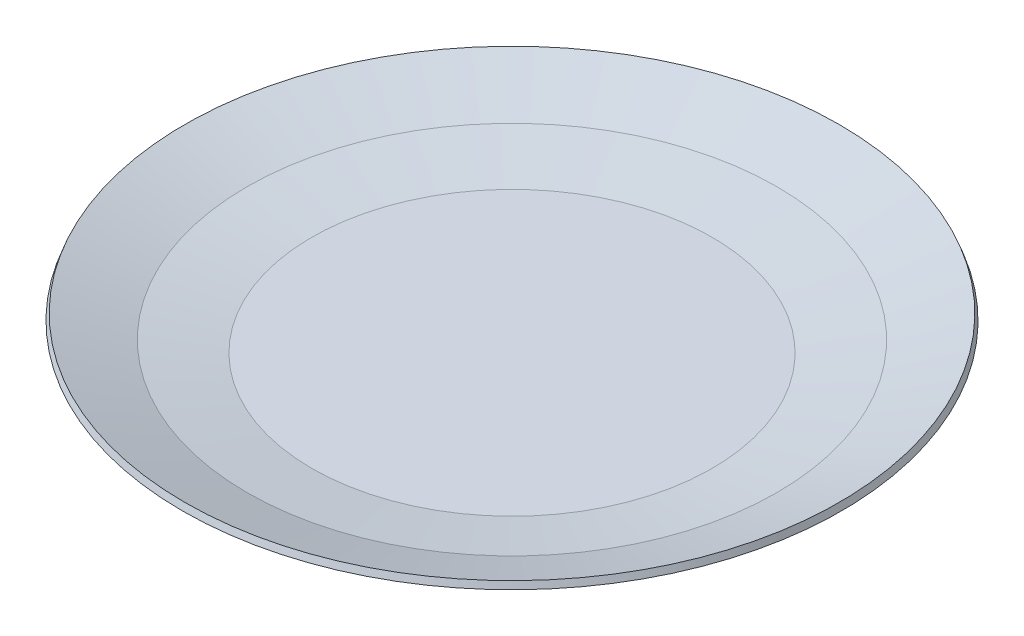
from build123d import *


with BuildPart() as part:
    # Sketch2 → Revolve1 (revolve)
    with BuildSketch(Plane.XY, mode=Mode.PRIVATE) as revolve1_sk:
        with BuildLine():
            Line((0, 1), (0, 0))
            Line((0, 0), (29.912511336, 0))
            ThreePointArc((29.912511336, 0), (29.999667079, 0.003805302), (30.086159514, 0.015192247))
            Line((30.086159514, 0.015192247), (39.761918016, 1.72128953))
            ThreePointArc((39.761918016, 1.72128953), (39.847088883, 1.740171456), (39.930289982, 1.766404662))
            Line((39.930289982, 1.766404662), (49.245003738, 5.15668321))
            Line((49.245003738, 5.15668321), (48.902983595, 6.096375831))
            Line((48.902983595, 6.096375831), (39.588269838, 2.706097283))
            Line((39.588269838, 2.706097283), (29.912511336, 1))
            Line((29.912511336, 1), (0, 1))
        make_face()
    revolve(revolve1_sk.sketch.rotate(Axis((0, 1, 0), (0, -1, 0)), 90), axis=Axis((0, 1, 0), (0, -1, 0)))


solid = part.part
